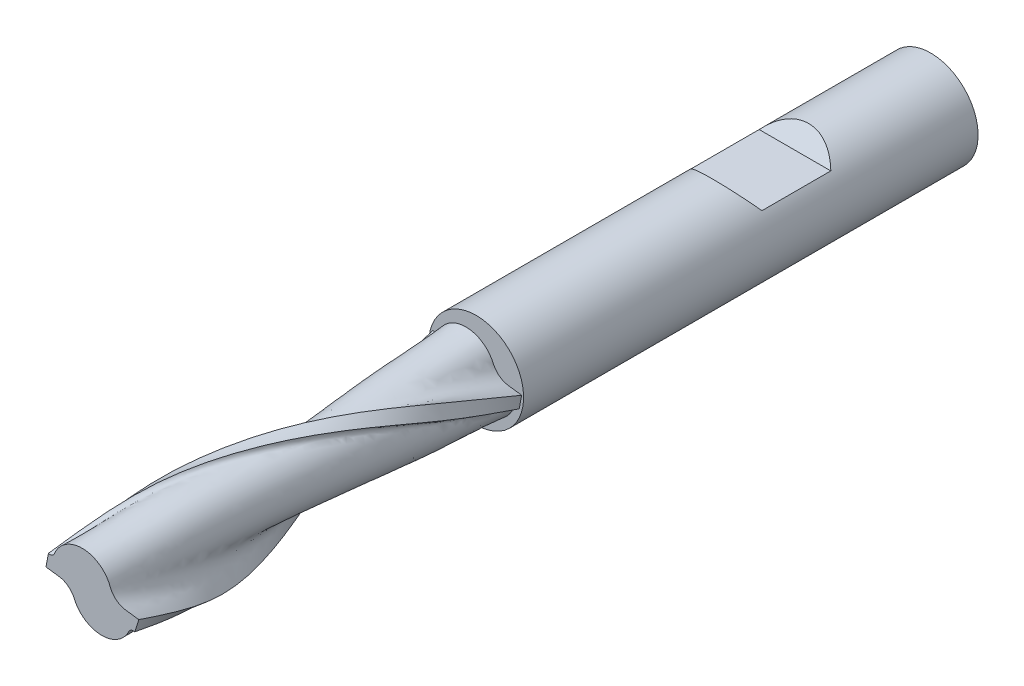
ISO-10303-21;
HEADER;
FILE_DESCRIPTION(('STEP AP214'),'2;1');
FILE_NAME('part.step','',(''),(''),'','','');
FILE_SCHEMA(('AUTOMOTIVE_DESIGN { 1 0 10303 214 1 1 1 1 }'));
ENDSEC;
DATA;
#1=APPLICATION_CONTEXT('core data for automotive mechanical design processes');
#2=APPLICATION_PROTOCOL_DEFINITION('international standard','automotive_design',2000,#1);
#3=PRODUCT_CONTEXT('',#1,'mechanical');
#4=PRODUCT('Part','Part','',(#3));
#5=PRODUCT_RELATED_PRODUCT_CATEGORY('part','',(#4));
#6=PRODUCT_DEFINITION_FORMATION('','',#4);
#7=PRODUCT_DEFINITION_CONTEXT('part definition',#1,'design');
#8=PRODUCT_DEFINITION('design','',#6,#7);
#9=PRODUCT_DEFINITION_SHAPE('','',#8);
#10=(LENGTH_UNIT() NAMED_UNIT(*) SI_UNIT(.MILLI.,.METRE.));
#11=(NAMED_UNIT(*) PLANE_ANGLE_UNIT() SI_UNIT($,.RADIAN.));
#12=(NAMED_UNIT(*) SI_UNIT($,.STERADIAN.) SOLID_ANGLE_UNIT());
#13=UNCERTAINTY_MEASURE_WITH_UNIT(LENGTH_MEASURE(1.E-05),#10,'distance_accuracy_value','');
#14=(GEOMETRIC_REPRESENTATION_CONTEXT(3) GLOBAL_UNCERTAINTY_ASSIGNED_CONTEXT((#13)) GLOBAL_UNIT_ASSIGNED_CONTEXT((#10,
#11,#12)) REPRESENTATION_CONTEXT('',''));
#15=CARTESIAN_POINT('',(0.,0.,0.));
#16=DIRECTION('',(0.,0.,1.));
#17=DIRECTION('',(1.,0.,0.));
#18=AXIS2_PLACEMENT_3D('',#15,#16,#17);
#19=CARTESIAN_POINT('',(4.86838101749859,2.7502276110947,50.7992299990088));
#20=DIRECTION('',(0.0005535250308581,-3.95874720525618E-07,-0.99999984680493));
#21=DIRECTION('',(0.999998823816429,-0.00143037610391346,0.000553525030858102));
#22=AXIS2_PLACEMENT_3D('',#19,#20,#21);
#23=PLANE('',#22);
#24=DIRECTION('',(-0.991036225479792,0.133592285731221,-0.000548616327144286));
#25=VECTOR('',#24,1.);
#26=CARTESIAN_POINT('',(6.25749999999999,0.,50.8));
#27=LINE('',#26,#25);
#28=CARTESIAN_POINT('',(6.25749999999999,0.,50.8));
#29=VERTEX_POINT('',#28);
#30=CARTESIAN_POINT('',(4.52905666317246,0.23299521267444,50.7990431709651));
#31=VERTEX_POINT('',#30);
#32=EDGE_CURVE('E244',#29,#31,#27,.T.);
#33=ORIENTED_EDGE('',*,*,#32,.T.);
#34=CARTESIAN_POINT('',(4.86838101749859,2.7502276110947,50.7992299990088));
#35=DIRECTION('',(0.0005535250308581,-3.95874720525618E-07,-0.99999984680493));
#36=DIRECTION('',(0.999998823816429,-0.00143037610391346,0.000553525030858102));
#37=AXIS2_PLACEMENT_3D('',#34,#35,#36);
#38=CIRCLE('',#37,2.54000000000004);
#39=CARTESIAN_POINT('',(2.49141543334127,1.85488807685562,50.7979146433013));
#40=VERTEX_POINT('',#39);
#41=EDGE_CURVE('E241',#31,#40,#38,.T.);
#42=ORIENTED_EDGE('',*,*,#41,.T.);
#43=CARTESIAN_POINT('',(-1.22241928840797,0.45598559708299,50.7958594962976));
#44=DIRECTION('',(-0.0005535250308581,3.95874720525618E-07,0.99999984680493));
#45=DIRECTION('',(-0.999998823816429,0.00143037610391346,-0.000553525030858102));
#46=AXIS2_PLACEMENT_3D('',#43,#44,#45);
#47=CIRCLE('',#46,3.96856406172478);
#48=CARTESIAN_POINT('',(-4.88731112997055,1.9785046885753,50.7938302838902));
#49=VERTEX_POINT('',#48);
#50=EDGE_CURVE('E238',#40,#49,#47,.T.);
#51=ORIENTED_EDGE('',*,*,#50,.T.);
#52=CARTESIAN_POINT('',(-5.4737213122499,2.22211916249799,50.7935055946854));
#53=DIRECTION('',(0.0005535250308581,-3.95874720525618E-07,-0.99999984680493));
#54=DIRECTION('',(0.999998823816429,-0.00143037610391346,0.000553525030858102));
#55=AXIS2_PLACEMENT_3D('',#52,#53,#54);
#56=CIRCLE('',#55,0.635000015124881);
#57=CARTESIAN_POINT('',(-5.55855240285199,1.59281104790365,50.7934588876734));
#58=VERTEX_POINT('',#57);
#59=EDGE_CURVE('E235',#49,#58,#56,.T.);
#60=ORIENTED_EDGE('',*,*,#59,.T.);
#61=DIRECTION('',(-0.991036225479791,0.13359228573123,-0.000548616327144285));
#62=VECTOR('',#61,1.);
#63=CARTESIAN_POINT('',(-5.55855240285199,1.59281104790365,50.7934588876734));
#64=LINE('',#63,#62);
#65=CARTESIAN_POINT('',(-5.6785293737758,1.60898401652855,50.7933924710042));
#66=VERTEX_POINT('',#65);
#67=EDGE_CURVE('E232',#58,#66,#64,.T.);
#68=ORIENTED_EDGE('',*,*,#67,.T.);
#69=DIRECTION('',(-0.182711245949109,-0.983166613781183,-0.000100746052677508));
#70=VECTOR('',#69,1.);
#71=CARTESIAN_POINT('',(-5.99808234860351,-0.110525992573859,50.7932162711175));
#72=LINE('',#71,#70);
#73=CARTESIAN_POINT('',(-5.99808234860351,-0.110525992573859,50.7932162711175));
#74=VERTEX_POINT('',#73);
#75=EDGE_CURVE('E229',#66,#74,#72,.T.);
#76=ORIENTED_EDGE('',*,*,#75,.T.);
#77=DIRECTION('',(0.991309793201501,-0.131546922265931,0.00054876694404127));
#78=VECTOR('',#77,1.);
#79=CARTESIAN_POINT('',(-5.99808234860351,-0.110525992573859,50.7932162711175));
#80=LINE('',#79,#78);
#81=CARTESIAN_POINT('',(-4.26916188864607,-0.339953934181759,50.7941733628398));
#82=VERTEX_POINT('',#81);
#83=EDGE_CURVE('E226',#74,#82,#80,.T.);
#84=ORIENTED_EDGE('',*,*,#83,.T.);
#85=CARTESIAN_POINT('',(-4.60329102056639,-2.85788119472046,50.7939894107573));
#86=DIRECTION('',(0.0005535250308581,-3.95874720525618E-07,-0.99999984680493));
#87=DIRECTION('',(0.999998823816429,-0.00143037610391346,0.000553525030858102));
#88=AXIS2_PLACEMENT_3D('',#85,#86,#87);
#89=CIRCLE('',#88,2.54000000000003);
#90=CARTESIAN_POINT('',(-2.27038428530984,-1.85331935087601,50.7952803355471));
#91=VERTEX_POINT('',#90);
#92=EDGE_CURVE('E223',#82,#91,#89,.T.);
#93=ORIENTED_EDGE('',*,*,#92,.T.);
#94=CARTESIAN_POINT('',(1.37461171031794,-0.283765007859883,50.7972973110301));
#95=DIRECTION('',(-0.0005535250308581,3.95874720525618E-07,0.99999984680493));
#96=DIRECTION('',(0.999998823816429,-0.00143037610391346,0.000553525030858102));
#97=AXIS2_PLACEMENT_3D('',#94,#95,#96);
#98=CIRCLE('',#97,3.96856406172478);
#99=CARTESIAN_POINT('',(4.95068292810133,-2.00458209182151,50.7992774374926));
#100=VERTEX_POINT('',#99);
#101=EDGE_CURVE('E220',#91,#100,#98,.T.);
#102=ORIENTED_EDGE('',*,*,#101,.T.);
#103=CARTESIAN_POINT('',(5.52288114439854,-2.27992573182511,50.7995942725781));
#104=DIRECTION('',(0.0005535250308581,-3.95874720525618E-07,-0.99999984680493));
#105=DIRECTION('',(-0.999998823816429,0.00143037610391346,-0.000553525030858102));
#106=AXIS2_PLACEMENT_3D('',#103,#104,#105);
#107=CIRCLE('',#106,0.635000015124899);
#108=CARTESIAN_POINT('',(5.60641342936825,-1.65044390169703,50.7996402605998));
#109=VERTEX_POINT('',#108);
#110=EDGE_CURVE('E217',#100,#109,#107,.T.);
#111=ORIENTED_EDGE('',*,*,#110,.T.);
#112=DIRECTION('',(0.9913097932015,-0.131546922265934,0.00054876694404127));
#113=VECTOR('',#112,1.);
#114=CARTESIAN_POINT('',(5.72642351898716,-1.66636925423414,50.799706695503));
#115=LINE('',#114,#113);
#116=CARTESIAN_POINT('',(5.72642351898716,-1.66636925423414,50.799706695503));
#117=VERTEX_POINT('',#116);
#118=EDGE_CURVE('E214',#109,#117,#115,.T.);
#119=ORIENTED_EDGE('',*,*,#118,.T.);
#120=DIRECTION('',(0.303654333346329,0.952782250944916,0.000167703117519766));
#121=VECTOR('',#120,1.);
#122=CARTESIAN_POINT('',(6.25749999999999,0.,50.8));
#123=LINE('',#122,#121);
#124=EDGE_CURVE('E155',#117,#29,#123,.T.);
#125=ORIENTED_EDGE('',*,*,#124,.T.);
#126=EDGE_LOOP('',(#33,#42,#51,#60,#68,#76,#84,#93,#102,#111,#119,#125));
#127=FACE_BOUND('',#126,.T.);
#128=ADVANCED_FACE('F29',(#127),#23,.F.);
#129=CARTESIAN_POINT('',(-5.72880751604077,1.6671271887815,0.));
#130=CARTESIAN_POINT('',(-5.85990323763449,0.491423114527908,3.16051720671));
#131=CARTESIAN_POINT('',(-6.12204647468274,-1.85955270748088,9.48038944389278));
#132=CARTESIAN_POINT('',(-3.94449531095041,-4.9155339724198,18.9685630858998));
#133=CARTESIAN_POINT('',(-0.433616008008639,-6.36220092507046,29.0078604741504));
#134=CARTESIAN_POINT('',(3.75787425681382,-5.38234695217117,39.6233627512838));
#135=CARTESIAN_POINT('',(5.07027525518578,-2.90496275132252,47.0744564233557));
#136=CARTESIAN_POINT('',(5.72642351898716,-1.66636925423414,50.799706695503));
#137=CARTESIAN_POINT('',(-5.90503834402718,1.11141812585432,0.));
#138=CARTESIAN_POINT('',(-5.92164174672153,-0.0798295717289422,3.16050721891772));
#139=CARTESIAN_POINT('',(-5.95484244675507,-2.4618869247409,9.48035948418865));
#140=CARTESIAN_POINT('',(-3.47394434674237,-5.31314633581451,18.9686846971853));
#141=CARTESIAN_POINT('',(0.187027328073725,-6.41993953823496,29.0079403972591));
#142=CARTESIAN_POINT('',(4.29280588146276,-5.02827387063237,39.6234379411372));
#143=CARTESIAN_POINT('',(5.36659646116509,-2.41663054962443,47.0745466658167));
#144=CARTESIAN_POINT('',(5.9034490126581,-1.11091283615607,50.7998044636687));
#145=CARTESIAN_POINT('',(-6.08126917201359,0.555709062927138,0.));
#146=CARTESIAN_POINT('',(-5.98338025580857,-0.651082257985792,3.16049723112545));
#147=CARTESIAN_POINT('',(-5.78763841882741,-3.06422114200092,9.48032952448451));
#148=CARTESIAN_POINT('',(-3.00339338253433,-5.71075869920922,18.9688063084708));
#149=CARTESIAN_POINT('',(0.80767066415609,-6.47767815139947,29.0080203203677));
#150=CARTESIAN_POINT('',(4.82773750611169,-4.67420078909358,39.6235131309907));
#151=CARTESIAN_POINT('',(5.6629176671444,-1.92829834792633,47.0746369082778));
#152=CARTESIAN_POINT('',(6.08047450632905,-0.555456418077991,50.7999022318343));
#153=CARTESIAN_POINT('',(-6.2575,0.,0.));
#154=CARTESIAN_POINT('',(-6.04511876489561,-1.22233494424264,3.16048724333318));
#155=CARTESIAN_POINT('',(-5.62043439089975,-3.66655535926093,9.48029956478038));
#156=CARTESIAN_POINT('',(-2.53284241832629,-6.10837106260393,18.9689279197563));
#157=CARTESIAN_POINT('',(1.42831400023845,-6.53541676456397,29.0081002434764));
#158=CARTESIAN_POINT('',(5.36266913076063,-4.32012770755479,39.6235883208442));
#159=CARTESIAN_POINT('',(5.95923887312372,-1.43996614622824,47.0747271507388));
#160=CARTESIAN_POINT('',(6.25749999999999,0.,50.8));
#161=B_SPLINE_SURFACE_WITH_KNOTS('',3,3,((#129,#130,#131,#132,#133,#134,#135,#136),(#137,#138,
#139,#140,#141,#142,#143,#144),(#145,#146,#147,#148,#149,#150,#151,#152),(#153,#154,#155,#156,
#157,#158,#159,#160)),.UNSPECIFIED.,.F.,.F.,.F.,(4,4),(4,1,1,1,1,4),(0.938550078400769,1.),(0.,
0.186719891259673,0.373371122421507,0.560117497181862,0.780076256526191,1.),.UNSPECIFIED.);
#162=DIRECTION('',(-0.30229123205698,-0.953215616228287,0.));
#163=VECTOR('',#162,1.);
#164=CARTESIAN_POINT('',(-6.2575,0.,0.));
#165=LINE('',#164,#163);
#166=CARTESIAN_POINT('',(-5.72880751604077,1.6671271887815,0.));
#167=VERTEX_POINT('',#166);
#168=CARTESIAN_POINT('',(-6.2575,0.,0.));
#169=VERTEX_POINT('',#168);
#170=EDGE_CURVE('E146',#167,#169,#165,.T.);
#171=CARTESIAN_POINT('',(-6.2575,0.,0.));
#172=CARTESIAN_POINT('',(-6.04511876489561,-1.22233494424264,3.16048724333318));
#173=CARTESIAN_POINT('',(-5.62043439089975,-3.66655535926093,9.48029956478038));
#174=CARTESIAN_POINT('',(-2.53284241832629,-6.10837106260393,18.9689279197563));
#175=CARTESIAN_POINT('',(1.42831400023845,-6.53541676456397,29.0081002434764));
#176=CARTESIAN_POINT('',(5.36266913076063,-4.32012770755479,39.6235883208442));
#177=CARTESIAN_POINT('',(5.95923887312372,-1.43996614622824,47.0747271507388));
#178=CARTESIAN_POINT('',(6.25749999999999,0.,50.8));
#179=B_SPLINE_CURVE_WITH_KNOTS('',3,(#171,#172,#173,#174,#175,#176,#177,#178),.UNSPECIFIED.,.F.,
.F.,(4,1,1,1,1,4),(0.,0.186719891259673,0.373371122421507,0.560117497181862,0.780076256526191,
1.),.UNSPECIFIED.);
#180=EDGE_CURVE('E170',#169,#29,#179,.T.);
#181=CARTESIAN_POINT('',(-5.72880751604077,1.6671271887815,0.));
#182=CARTESIAN_POINT('',(-5.85990323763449,0.491423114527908,3.16051720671));
#183=CARTESIAN_POINT('',(-6.12204647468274,-1.85955270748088,9.48038944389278));
#184=CARTESIAN_POINT('',(-3.94449531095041,-4.9155339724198,18.9685630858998));
#185=CARTESIAN_POINT('',(-0.433616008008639,-6.36220092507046,29.0078604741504));
#186=CARTESIAN_POINT('',(3.75787425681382,-5.38234695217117,39.6233627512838));
#187=CARTESIAN_POINT('',(5.07027525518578,-2.90496275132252,47.0744564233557));
#188=CARTESIAN_POINT('',(5.72642351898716,-1.66636925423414,50.799706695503));
#189=B_SPLINE_CURVE_WITH_KNOTS('',3,(#181,#182,#183,#184,#185,#186,#187,#188),.UNSPECIFIED.,.F.,
.F.,(4,1,1,1,1,4),(0.,0.186719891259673,0.373371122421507,0.560117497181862,0.780076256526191,
1.),.UNSPECIFIED.);
#190=EDGE_CURVE('E163',#167,#117,#189,.T.);
#191=ORIENTED_EDGE('',*,*,#170,.T.);
#192=ORIENTED_EDGE('',*,*,#180,.T.);
#193=ORIENTED_EDGE('',*,*,#124,.F.);
#194=ORIENTED_EDGE('',*,*,#190,.F.);
#195=EDGE_LOOP('',(#191,#192,#193,#194));
#196=FACE_BOUND('',#195,.T.);
#197=ADVANCED_FACE('F262',(#196),#161,.T.);
#198=CARTESIAN_POINT('',(5.99791359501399,0.128055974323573,0.));
#199=CARTESIAN_POINT('',(5.76919163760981,1.29439054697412,3.16109072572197));
#200=CARTESIAN_POINT('',(5.31183182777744,3.62663081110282,9.48210979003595));
#201=CARTESIAN_POINT('',(2.31951774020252,5.899436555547,18.9598958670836));
#202=CARTESIAN_POINT('',(-1.49250196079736,6.23906689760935,29.0040798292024));
#203=CARTESIAN_POINT('',(-5.22022430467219,4.0393450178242,39.6192683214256));
#204=CARTESIAN_POINT('',(-5.73881009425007,1.2726909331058,47.0687646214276));
#205=CARTESIAN_POINT('',(-5.99808234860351,-0.110525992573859,50.7932162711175));
#206=CARTESIAN_POINT('',(5.4214978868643,0.203707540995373,0.));
#207=CARTESIAN_POINT('',(5.19757465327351,1.2549214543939,3.16106253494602));
#208=CARTESIAN_POINT('',(4.74981052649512,3.35696273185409,9.48202522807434));
#209=CARTESIAN_POINT('',(2.01161619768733,5.36783707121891,18.9603218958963));
#210=CARTESIAN_POINT('',(-1.44045343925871,5.61966368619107,29.0042656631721));
#211=CARTESIAN_POINT('',(-4.77891449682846,3.57623080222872,39.619469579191));
#212=CARTESIAN_POINT('',(-5.20749989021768,1.06734238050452,47.0690443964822));
#213=CARTESIAN_POINT('',(-5.42177552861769,-0.187001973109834,50.7935353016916));
#214=CARTESIAN_POINT('',(4.84508217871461,0.279359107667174,0.));
#215=CARTESIAN_POINT('',(4.62595766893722,1.21545236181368,3.16103434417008));
#216=CARTESIAN_POINT('',(4.18778922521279,3.08729465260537,9.48194066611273));
#217=CARTESIAN_POINT('',(1.70371465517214,4.83623758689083,18.960747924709));
#218=CARTESIAN_POINT('',(-1.38840491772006,5.00026047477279,29.0044514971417));
#219=CARTESIAN_POINT('',(-4.33760468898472,3.11311658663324,39.6196708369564));
#220=CARTESIAN_POINT('',(-4.67618968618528,0.861993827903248,47.0693241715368));
#221=CARTESIAN_POINT('',(-4.84546870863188,-0.263477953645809,50.7938543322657));
#222=CARTESIAN_POINT('',(4.26866647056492,0.355010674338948,0.));
#223=CARTESIAN_POINT('',(4.05434068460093,1.17598326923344,3.16100615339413));
#224=CARTESIAN_POINT('',(3.62576792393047,2.81762657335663,9.48185610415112));
#225=CARTESIAN_POINT('',(1.39581311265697,4.30463810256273,18.9611739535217));
#226=CARTESIAN_POINT('',(-1.33635639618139,4.38085726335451,29.0046373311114));
#227=CARTESIAN_POINT('',(-3.89629488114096,2.65000237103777,39.6198720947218));
#228=CARTESIAN_POINT('',(-4.14487948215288,0.656645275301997,47.0696039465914));
#229=CARTESIAN_POINT('',(-4.26916188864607,-0.339953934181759,50.7941733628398));
#230=CARTESIAN_POINT('',(3.36128350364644,0.474099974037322,0.));
#231=CARTESIAN_POINT('',(3.15451178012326,1.11385175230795,3.16096177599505));
#232=CARTESIAN_POINT('',(2.74104436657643,2.39312006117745,9.48172298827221));
#233=CARTESIAN_POINT('',(0.911120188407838,3.46780400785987,18.961844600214));
#234=CARTESIAN_POINT('',(-1.25442257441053,3.40580416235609,29.0049298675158));
#235=CARTESIAN_POINT('',(-3.20159312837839,1.92097652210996,39.6201889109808));
#236=CARTESIAN_POINT('',(-3.30850076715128,0.333389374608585,47.0700443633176));
#237=CARTESIAN_POINT('',(-3.36195033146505,-0.460341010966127,50.7946755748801));
#238=CARTESIAN_POINT('',(2.63087248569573,1.02548536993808,0.));
#239=CARTESIAN_POINT('',(2.34123521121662,1.50389481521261,3.16092713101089));
#240=CARTESIAN_POINT('',(1.76206716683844,2.46053778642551,9.48161906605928));
#241=CARTESIAN_POINT('',(0.0765731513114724,2.97918361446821,18.9623912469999));
#242=CARTESIAN_POINT('',(-1.66436732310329,2.51732958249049,29.0051471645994));
#243=CARTESIAN_POINT('',(-2.95717284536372,0.944069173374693,39.6204331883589));
#244=CARTESIAN_POINT('',(-2.74060444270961,-0.360525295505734,47.0703951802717));
#245=CARTESIAN_POINT('',(-2.63232886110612,-1.01277060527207,50.7950796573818));
#246=CARTESIAN_POINT('',(2.26772592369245,1.86551553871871,0.));
#247=CARTESIAN_POINT('',(1.82639227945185,2.2444953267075,3.16091124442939));
#248=CARTESIAN_POINT('',(0.943887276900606,3.00231554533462,9.48157141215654));
#249=CARTESIAN_POINT('',(-0.890405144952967,2.96607620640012,18.9626714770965));
#250=CARTESIAN_POINT('',(-2.45938856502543,1.94690601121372,29.0052326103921));
#251=CARTESIAN_POINT('',(-3.2267123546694,-0.0262079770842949,39.6205412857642));
#252=CARTESIAN_POINT('',(-2.58914339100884,-1.24431454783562,47.0705649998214));
#253=CARTESIAN_POINT('',(-2.27038428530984,-1.85331935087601,50.7952803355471));
#254=CARTESIAN_POINT('',(0.700986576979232,5.48969501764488,0.));
#255=CARTESIAN_POINT('',(-0.394817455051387,5.43970101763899,3.16084270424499));
#256=CARTESIAN_POINT('',(-2.58602257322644,5.33973140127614,9.48136581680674));
#257=CARTESIAN_POINT('',(-5.0622825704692,2.90952633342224,18.963880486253));
#258=CARTESIAN_POINT('',(-5.88938403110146,-0.514097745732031,29.0056012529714));
#259=CARTESIAN_POINT('',(-4.38959863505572,-4.21231779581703,39.6210076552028));
#260=CARTESIAN_POINT('',(-1.93568824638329,-5.0572857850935,47.0712976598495));
#261=CARTESIAN_POINT('',(-0.708830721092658,-5.47973614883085,50.7961461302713));
#262=CARTESIAN_POINT('',(-3.24659666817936,5.56673785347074,0.));
#263=CARTESIAN_POINT('',(-4.22341495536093,4.74331483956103,3.16064859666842));
#264=CARTESIAN_POINT('',(-6.17669233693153,3.09677159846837,9.48078356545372));
#265=CARTESIAN_POINT('',(-6.74067209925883,-0.910259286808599,18.9667915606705));
#266=CARTESIAN_POINT('',(-5.07214400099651,-4.65577911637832,29.0068915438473));
#267=CARTESIAN_POINT('',(-1.06249490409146,-7.00627541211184,39.6223963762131));
#268=CARTESIAN_POINT('',(1.80500290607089,-6.04368321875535,47.073217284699));
#269=CARTESIAN_POINT('',(3.23863768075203,-5.56242543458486,50.7983311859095));
#270=CARTESIAN_POINT('',(-4.95355137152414,2.00644928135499,0.));
#271=CARTESIAN_POINT('',(-5.17722549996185,0.970602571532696,3.16055616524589));
#272=CARTESIAN_POINT('',(-5.62449150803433,-1.10070994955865,9.48050630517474));
#273=CARTESIAN_POINT('',(-3.96066749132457,-4.02142208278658,18.9679966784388));
#274=CARTESIAN_POINT('',(-0.964418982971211,-5.62943317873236,29.0075929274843));
#275=CARTESIAN_POINT('',(2.85952753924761,-5.13716864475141,39.6230816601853));
#276=CARTESIAN_POINT('',(4.25366812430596,-3.04872219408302,47.0740765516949));
#277=CARTESIAN_POINT('',(4.95068292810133,-2.00458209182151,50.7992774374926));
#278=CARTESIAN_POINT('',(-5.07654983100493,1.74990468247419,0.));
#279=CARTESIAN_POINT('',(-5.24595446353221,0.698751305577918,3.16054950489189));
#280=CARTESIAN_POINT('',(-5.58470143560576,-1.40316892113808,9.48048632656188));
#281=CARTESIAN_POINT('',(-3.76034800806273,-4.24560391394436,18.9680835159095));
#282=CARTESIAN_POINT('',(-0.668427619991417,-5.6995920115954,29.0076434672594));
#283=CARTESIAN_POINT('',(3.14213768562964,-5.00248595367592,39.6231310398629));
#284=CARTESIAN_POINT('',(4.43011220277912,-2.83291354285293,47.0741384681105));
#285=CARTESIAN_POINT('',(5.07404819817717,-1.74821368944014,50.7993456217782));
#286=CARTESIAN_POINT('',(-5.32668772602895,1.61435105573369,0.));
#287=CARTESIAN_POINT('',(-5.46113113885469,0.518957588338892,3.16053687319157));
#288=CARTESIAN_POINT('',(-5.72996852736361,-1.67142655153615,9.4804484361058));
#289=CARTESIAN_POINT('',(-3.72969668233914,-4.54467892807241,18.968265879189));
#290=CARTESIAN_POINT('',(-0.469926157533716,-5.93009214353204,29.0077308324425));
#291=CARTESIAN_POINT('',(3.45000720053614,-5.05926867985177,39.6232223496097));
#292=CARTESIAN_POINT('',(4.69962201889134,-2.76170725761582,47.07426124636));
#293=CARTESIAN_POINT('',(5.3243796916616,-1.61301799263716,50.7994841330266));
#294=CARTESIAN_POINT('',(-5.60877475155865,1.65137351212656,0.));
#295=CARTESIAN_POINT('',(-5.74086975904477,0.499642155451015,3.1605230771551));
#296=CARTESIAN_POINT('',(-6.00501120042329,-1.80339704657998,9.48040705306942));
#297=CARTESIAN_POINT('',(-3.88037791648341,-4.80483373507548,18.9684743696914));
#298=CARTESIAN_POINT('',(-0.444454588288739,-6.23321644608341,29.0078217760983));
#299=CARTESIAN_POINT('',(3.66597593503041,-5.28590808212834,39.6233208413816));
#300=CARTESIAN_POINT('',(4.95963525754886,-2.86220098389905,47.074398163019));
#301=CARTESIAN_POINT('',(5.60641342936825,-1.65044390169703,50.7996402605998));
#302=CARTESIAN_POINT('',(-5.64878567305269,1.65662473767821,0.));
#303=CARTESIAN_POINT('',(-5.78054758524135,0.496902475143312,3.16052112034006));
#304=CARTESIAN_POINT('',(-6.04402295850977,-1.82211560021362,9.48040118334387));
#305=CARTESIAN_POINT('',(-3.90175038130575,-4.84173381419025,18.9685039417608));
#306=CARTESIAN_POINT('',(-0.440841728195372,-6.27621127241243,29.007834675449));
#307=CARTESIAN_POINT('',(3.69660870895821,-5.31805437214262,39.6233348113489));
#308=CARTESIAN_POINT('',(4.99651525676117,-2.87645490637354,47.0744175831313));
#309=CARTESIAN_POINT('',(5.64641679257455,-1.65575235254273,50.7996624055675));
#310=CARTESIAN_POINT('',(-5.68879659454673,1.66187596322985,0.));
#311=CARTESIAN_POINT('',(-5.82022541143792,0.49416279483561,3.16051916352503));
#312=CARTESIAN_POINT('',(-6.08303471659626,-1.84083415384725,9.48039531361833));
#313=CARTESIAN_POINT('',(-3.92312284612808,-4.87863389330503,18.9685335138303));
#314=CARTESIAN_POINT('',(-0.437228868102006,-6.31920609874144,29.0078475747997));
#315=CARTESIAN_POINT('',(3.72724148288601,-5.35020066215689,39.6233487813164));
#316=CARTESIAN_POINT('',(5.03339525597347,-2.89070882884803,47.0744370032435));
#317=CARTESIAN_POINT('',(5.68642015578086,-1.66106080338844,50.7996845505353));
#318=CARTESIAN_POINT('',(-5.72880751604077,1.6671271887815,0.));
#319=CARTESIAN_POINT('',(-5.85990323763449,0.491423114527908,3.16051720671));
#320=CARTESIAN_POINT('',(-6.12204647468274,-1.85955270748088,9.48038944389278));
#321=CARTESIAN_POINT('',(-3.94449531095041,-4.9155339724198,18.9685630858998));
#322=CARTESIAN_POINT('',(-0.433616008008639,-6.36220092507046,29.0078604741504));
#323=CARTESIAN_POINT('',(3.75787425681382,-5.38234695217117,39.6233627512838));
#324=CARTESIAN_POINT('',(5.07027525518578,-2.90496275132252,47.0744564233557));
#325=CARTESIAN_POINT('',(5.72642351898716,-1.66636925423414,50.799706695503));
#326=(BOUNDED_SURFACE() B_SPLINE_SURFACE(3,3,((#198,#199,#200,#201,#202,#203,#204,#205),(#206,
#207,#208,#209,#210,#211,#212,#213),(#214,#215,#216,#217,#218,#219,#220,#221),(#222,#223,#224,
#225,#226,#227,#228,#229),(#230,#231,#232,#233,#234,#235,#236,#237),(#238,#239,#240,#241,#242,
#243,#244,#245),(#246,#247,#248,#249,#250,#251,#252,#253),(#254,#255,#256,#257,#258,#259,#260,
#261),(#262,#263,#264,#265,#266,#267,#268,#269),(#270,#271,#272,#273,#274,#275,#276,#277),(#278,
#279,#280,#281,#282,#283,#284,#285),(#286,#287,#288,#289,#290,#291,#292,#293),(#294,#295,#296,
#297,#298,#299,#300,#301),(#302,#303,#304,#305,#306,#307,#308,#309),(#310,#311,#312,#313,#314,
#315,#316,#317),(#318,#319,#320,#321,#322,#323,#324,#325)),.UNSPECIFIED.,.F.,.F.,
.F.) B_SPLINE_SURFACE_WITH_KNOTS((4,3,3,3,3,4),(4,1,1,1,1,4),(0.504976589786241,
0.566255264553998,0.654341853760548,0.908111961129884,0.934296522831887,0.938550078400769),(0.,
0.186719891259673,0.373371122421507,0.560117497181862,0.780076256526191,1.),
.UNSPECIFIED.) GEOMETRIC_REPRESENTATION_ITEM() RATIONAL_B_SPLINE_SURFACE(((1.,1.,1.,1.,1.,1.,1.,
1.),(1.,1.,1.,1.,1.,1.,1.,1.),(1.,1.,1.,1.,1.,1.,1.,1.),(1.,1.,1.,1.,1.,1.,1.,1.),
(0.913157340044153,0.913157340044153,0.913157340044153,0.913157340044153,0.913157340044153,
0.913157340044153,0.913157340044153,0.913157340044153),(0.913157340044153,0.913157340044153,
0.913157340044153,0.913157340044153,0.913157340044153,0.913157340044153,0.913157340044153,
0.913157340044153),(1.,1.,1.,1.,1.,1.,1.,1.),(0.609763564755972,0.609763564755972,
0.609763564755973,0.609763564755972,0.609763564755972,0.609763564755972,0.609763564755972,
0.609763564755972),(0.609763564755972,0.609763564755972,0.609763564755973,0.609763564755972,
0.609763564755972,0.609763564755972,0.609763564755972,0.609763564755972),(1.,1.,1.,1.,1.,1.,1.,
1.),(0.873149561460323,0.873149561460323,0.873149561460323,0.873149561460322,0.873149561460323,
0.873149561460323,0.873149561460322,0.873149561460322),(0.873149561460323,0.873149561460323,
0.873149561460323,0.873149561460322,0.873149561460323,0.873149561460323,0.873149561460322,
0.873149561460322),(1.,1.,1.,1.,1.,1.,1.,1.),(1.,1.,1.,1.,1.,1.,1.,1.),(1.,1.,1.,1.,1.,1.,1.,
1.),(1.,1.,1.,1.,1.,1.,1.,1.))) REPRESENTATION_ITEM('') SURFACE());
#327=DIRECTION('',(-0.991497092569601,0.130128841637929,0.));
#328=VECTOR('',#327,1.);
#329=CARTESIAN_POINT('',(5.99791359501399,0.128055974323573,0.));
#330=LINE('',#329,#328);
#331=CARTESIAN_POINT('',(5.99791359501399,0.128055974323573,0.));
#332=VERTEX_POINT('',#331);
#333=CARTESIAN_POINT('',(4.26866647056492,0.355010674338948,0.));
#334=VERTEX_POINT('',#333);
#335=EDGE_CURVE('E196',#332,#334,#330,.T.);
#336=CARTESIAN_POINT('',(4.59919372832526,2.87341328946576,0.));
#337=DIRECTION('',(0.,0.,-1.));
#338=DIRECTION('',(-1.,0.,0.));
#339=AXIS2_PLACEMENT_3D('',#336,#337,#338);
#340=CIRCLE('',#339,2.54000000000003);
#341=CARTESIAN_POINT('',(2.26772592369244,1.86551553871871,0.));
#342=VERTEX_POINT('',#341);
#343=EDGE_CURVE('E193',#334,#342,#340,.T.);
#344=CARTESIAN_POINT('',(-1.3750218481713,0.29074908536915,0.));
#345=DIRECTION('',(0.,0.,1.));
#346=DIRECTION('',(-1.,0.,0.));
#347=AXIS2_PLACEMENT_3D('',#344,#345,#346);
#348=CIRCLE('',#347,3.96856406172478);
#349=CARTESIAN_POINT('',(-4.95355137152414,2.00644928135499,0.));
#350=VERTEX_POINT('',#349);
#351=EDGE_CURVE('E190',#342,#350,#348,.T.);
#352=CARTESIAN_POINT('',(-5.52614293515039,2.2809741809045,0.));
#353=DIRECTION('',(0.,0.,-1.));
#354=DIRECTION('',(1.,0.,0.));
#355=AXIS2_PLACEMENT_3D('',#352,#353,#354);
#356=CIRCLE('',#355,0.635000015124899);
#357=CARTESIAN_POINT('',(-5.60877475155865,1.65137351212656,0.));
#358=VERTEX_POINT('',#357);
#359=EDGE_CURVE('E187',#350,#358,#356,.T.);
#360=DIRECTION('',(-0.9914970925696,0.130128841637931,0.));
#361=VECTOR('',#360,1.);
#362=CARTESIAN_POINT('',(-5.72880751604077,1.6671271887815,0.));
#363=LINE('',#362,#361);
#364=EDGE_CURVE('E184',#358,#167,#363,.T.);
#365=CARTESIAN_POINT('',(5.99791359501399,0.128055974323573,0.));
#366=CARTESIAN_POINT('',(5.76919163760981,1.29439054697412,3.16109072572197));
#367=CARTESIAN_POINT('',(5.31183182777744,3.62663081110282,9.48210979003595));
#368=CARTESIAN_POINT('',(2.31951774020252,5.899436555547,18.9598958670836));
#369=CARTESIAN_POINT('',(-1.49250196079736,6.23906689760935,29.0040798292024));
#370=CARTESIAN_POINT('',(-5.22022430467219,4.0393450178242,39.6192683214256));
#371=CARTESIAN_POINT('',(-5.73881009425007,1.2726909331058,47.0687646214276));
#372=CARTESIAN_POINT('',(-5.99808234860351,-0.110525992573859,50.7932162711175));
#373=B_SPLINE_CURVE_WITH_KNOTS('',3,(#365,#366,#367,#368,#369,#370,#371,#372),.UNSPECIFIED.,.F.,
.F.,(4,1,1,1,1,4),(0.,0.186719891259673,0.373371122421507,0.560117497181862,0.780076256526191,
1.),.UNSPECIFIED.);
#374=EDGE_CURVE('E154',#332,#74,#373,.T.);
#375=ORIENTED_EDGE('',*,*,#335,.T.);
#376=ORIENTED_EDGE('',*,*,#343,.T.);
#377=ORIENTED_EDGE('',*,*,#351,.T.);
#378=ORIENTED_EDGE('',*,*,#359,.T.);
#379=ORIENTED_EDGE('',*,*,#364,.T.);
#380=ORIENTED_EDGE('',*,*,#190,.T.);
#381=ORIENTED_EDGE('',*,*,#118,.F.);
#382=ORIENTED_EDGE('',*,*,#110,.F.);
#383=ORIENTED_EDGE('',*,*,#101,.F.);
#384=ORIENTED_EDGE('',*,*,#92,.F.);
#385=ORIENTED_EDGE('',*,*,#83,.F.);
#386=ORIENTED_EDGE('',*,*,#374,.F.);
#387=EDGE_LOOP('',(#375,#376,#377,#378,#379,#380,#381,#382,#383,#384,#385,#386));
#388=FACE_BOUND('',#387,.T.);
#389=ADVANCED_FACE('F264',(#388),#326,.T.);
#390=CARTESIAN_POINT('',(5.68082044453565,-1.59190935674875,0.));
#391=CARTESIAN_POINT('',(5.79870845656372,-0.429094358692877,3.16107105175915));
#392=CARTESIAN_POINT('',(6.03444113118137,1.89610805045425,9.48205077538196));
#393=CARTESIAN_POINT('',(3.86865376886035,4.89156660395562,18.9601039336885));
#394=CARTESIAN_POINT('',(0.376509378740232,6.29893139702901,29.004252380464));
#395=CARTESIAN_POINT('',(-3.76010957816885,5.29303609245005,39.6194206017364));
#396=CARTESIAN_POINT('',(-5.03909004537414,2.83693620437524,47.0689328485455));
#397=CARTESIAN_POINT('',(-5.6785293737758,1.60898401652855,50.7933924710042));
#398=CARTESIAN_POINT('',(5.78651816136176,-1.01858757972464,0.));
#399=CARTESIAN_POINT('',(5.78886951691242,0.145400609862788,3.16107760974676));
#400=CARTESIAN_POINT('',(5.79357136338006,2.47294897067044,9.48207044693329));
#401=CARTESIAN_POINT('',(3.35227509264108,5.22752325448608,18.9600345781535));
#402=CARTESIAN_POINT('',(-0.246494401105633,6.27897656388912,29.0041948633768));
#403=CARTESIAN_POINT('',(-4.2468144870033,4.87513906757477,39.6193698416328));
#404=CARTESIAN_POINT('',(-5.27233006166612,2.3155211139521,47.0688767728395));
#405=CARTESIAN_POINT('',(-5.7850470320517,1.03581401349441,50.7933337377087));
#406=CARTESIAN_POINT('',(5.89221587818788,-0.445265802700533,0.));
#407=CARTESIAN_POINT('',(5.77903057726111,0.719895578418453,3.16108416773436));
#408=CARTESIAN_POINT('',(5.55270159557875,3.04978989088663,9.48209011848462));
#409=CARTESIAN_POINT('',(2.8358964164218,5.56347990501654,18.9599652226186));
#410=CARTESIAN_POINT('',(-0.869498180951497,6.25902173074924,29.0041373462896));
#411=CARTESIAN_POINT('',(-4.73351939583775,4.45724204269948,39.6193190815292));
#412=CARTESIAN_POINT('',(-5.5055700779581,1.79410602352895,47.0688206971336));
#413=CARTESIAN_POINT('',(-5.8915646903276,0.462644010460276,50.7932750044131));
#414=CARTESIAN_POINT('',(5.99791359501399,0.128055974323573,0.));
#415=CARTESIAN_POINT('',(5.76919163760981,1.29439054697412,3.16109072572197));
#416=CARTESIAN_POINT('',(5.31183182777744,3.62663081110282,9.48210979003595));
#417=CARTESIAN_POINT('',(2.31951774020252,5.899436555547,18.9598958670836));
#418=CARTESIAN_POINT('',(-1.49250196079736,6.23906689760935,29.0040798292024));
#419=CARTESIAN_POINT('',(-5.22022430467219,4.0393450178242,39.6192683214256));
#420=CARTESIAN_POINT('',(-5.73881009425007,1.2726909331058,47.0687646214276));
#421=CARTESIAN_POINT('',(-5.99808234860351,-0.110525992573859,50.7932162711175));
#422=B_SPLINE_SURFACE_WITH_KNOTS('',3,3,((#390,#391,#392,#393,#394,#395,#396,#397),(#398,#399,
#400,#401,#402,#403,#404,#405),(#406,#407,#408,#409,#410,#411,#412,#413),(#414,#415,#416,#417,
#418,#419,#420,#421)),.UNSPECIFIED.,.F.,.F.,.F.,(4,4),(4,1,1,1,1,4),(0.443526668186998,
0.504976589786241),(0.,0.186719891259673,0.373371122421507,0.560117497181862,0.780076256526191,
1.),.UNSPECIFIED.);
#423=DIRECTION('',(0.181304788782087,0.983426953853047,0.));
#424=VECTOR('',#423,1.);
#425=CARTESIAN_POINT('',(5.99791359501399,0.128055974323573,0.));
#426=LINE('',#425,#424);
#427=CARTESIAN_POINT('',(5.68082044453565,-1.59190935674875,0.));
#428=VERTEX_POINT('',#427);
#429=EDGE_CURVE('E199',#428,#332,#426,.T.);
#430=CARTESIAN_POINT('',(5.68082044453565,-1.59190935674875,0.));
#431=CARTESIAN_POINT('',(5.79870845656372,-0.429094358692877,3.16107105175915));
#432=CARTESIAN_POINT('',(6.03444113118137,1.89610805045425,9.48205077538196));
#433=CARTESIAN_POINT('',(3.86865376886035,4.89156660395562,18.9601039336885));
#434=CARTESIAN_POINT('',(0.376509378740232,6.29893139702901,29.004252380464));
#435=CARTESIAN_POINT('',(-3.76010957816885,5.29303609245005,39.6194206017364));
#436=CARTESIAN_POINT('',(-5.03909004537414,2.83693620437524,47.0689328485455));
#437=CARTESIAN_POINT('',(-5.6785293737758,1.60898401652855,50.7933924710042));
#438=B_SPLINE_CURVE_WITH_KNOTS('',3,(#430,#431,#432,#433,#434,#435,#436,#437),.UNSPECIFIED.,.F.,
.F.,(4,1,1,1,1,4),(0.,0.186719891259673,0.373371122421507,0.560117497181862,0.780076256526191,
1.),.UNSPECIFIED.);
#439=EDGE_CURVE('E149',#428,#66,#438,.T.);
#440=ORIENTED_EDGE('',*,*,#429,.T.);
#441=ORIENTED_EDGE('',*,*,#374,.T.);
#442=ORIENTED_EDGE('',*,*,#75,.F.);
#443=ORIENTED_EDGE('',*,*,#439,.F.);
#444=EDGE_LOOP('',(#440,#441,#442,#443));
#445=FACE_BOUND('',#444,.T.);
#446=ADVANCED_FACE('F31',(#445),#422,.T.);
#447=CARTESIAN_POINT('',(-6.2575,0.,0.));
#448=CARTESIAN_POINT('',(-6.04511876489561,-1.22233494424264,3.16048724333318));
#449=CARTESIAN_POINT('',(-5.62043439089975,-3.66655535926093,9.48029956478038));
#450=CARTESIAN_POINT('',(-2.53284241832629,-6.10837106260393,18.9689279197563));
#451=CARTESIAN_POINT('',(1.42831400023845,-6.53541676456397,29.0081002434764));
#452=CARTESIAN_POINT('',(5.36266913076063,-4.32012770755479,39.6235883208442));
#453=CARTESIAN_POINT('',(5.95923887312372,-1.43996614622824,47.0747271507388));
#454=CARTESIAN_POINT('',(6.25749999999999,0.,50.8));
#455=CARTESIAN_POINT('',(-5.68124163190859,-0.0768408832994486,0.));
#456=CARTESIAN_POINT('',(-5.47342155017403,-1.18404551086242,3.1605154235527));
#457=CARTESIAN_POINT('',(-5.05785780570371,-3.3980476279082,9.48038409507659));
#458=CARTESIAN_POINT('',(-2.22384453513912,-5.57740808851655,18.9685019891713));
#459=CARTESIAN_POINT('',(1.37754377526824,-5.9159074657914,29.007914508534));
#460=CARTESIAN_POINT('',(4.92231593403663,-3.85610380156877,39.6233871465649));
#461=CARTESIAN_POINT('',(5.42835355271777,-1.23352163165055,47.0744474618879));
#462=CARTESIAN_POINT('',(5.68135222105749,0.0776650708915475,50.7996810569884));
#463=CARTESIAN_POINT('',(-5.10498326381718,-0.153681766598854,0.));
#464=CARTESIAN_POINT('',(-4.90172433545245,-1.1457560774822,3.16054360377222));
#465=CARTESIAN_POINT('',(-4.49528122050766,-3.12953989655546,9.48046862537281));
#466=CARTESIAN_POINT('',(-1.91484665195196,-5.04644511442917,18.9680760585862));
#467=CARTESIAN_POINT('',(1.32677355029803,-5.29639816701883,29.0077287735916));
#468=CARTESIAN_POINT('',(4.48196273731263,-3.39207989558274,39.6231859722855));
#469=CARTESIAN_POINT('',(4.89746823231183,-1.02707711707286,47.0741677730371));
#470=CARTESIAN_POINT('',(5.10520444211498,0.155330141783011,50.7993621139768));
#471=CARTESIAN_POINT('',(-4.52872489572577,-0.230522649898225,0.));
#472=CARTESIAN_POINT('',(-4.33002712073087,-1.10746664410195,3.16057178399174));
#473=CARTESIAN_POINT('',(-3.93270463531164,-2.86103216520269,9.48055315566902));
#474=CARTESIAN_POINT('',(-1.60584876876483,-4.51548214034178,18.9676501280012));
#475=CARTESIAN_POINT('',(1.27600332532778,-4.67688886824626,29.0075430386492));
#476=CARTESIAN_POINT('',(4.0416095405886,-2.92805598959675,39.6229847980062));
#477=CARTESIAN_POINT('',(4.36658291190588,-0.820632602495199,47.0738880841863));
#478=CARTESIAN_POINT('',(4.52905666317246,0.23299521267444,50.7990431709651));
#479=CARTESIAN_POINT('',(-3.57866718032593,-0.357207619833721,0.));
#480=CARTESIAN_POINT('',(-3.38748922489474,-1.04434014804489,3.16061824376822));
#481=CARTESIAN_POINT('',(-3.00520361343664,-2.41835253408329,9.48069251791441));
#482=CARTESIAN_POINT('',(-1.09641439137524,-3.6401014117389,18.9669479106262));
#483=CARTESIAN_POINT('',(1.19230016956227,-3.65552480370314,29.0072368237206));
#484=CARTESIAN_POINT('',(3.31561409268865,-2.16303544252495,39.6226531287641));
#485=CARTESIAN_POINT('',(3.49133020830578,-0.480274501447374,47.0734269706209));
#486=CARTESIAN_POINT('',(3.57918127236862,0.361038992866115,50.7985173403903));
#487=CARTESIAN_POINT('',(-2.82790376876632,-0.953037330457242,0.));
#488=CARTESIAN_POINT('',(-2.54587298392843,-1.47334449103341,3.16065378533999));
#489=CARTESIAN_POINT('',(-1.98191512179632,-2.51376748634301,9.48079912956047));
#490=CARTESIAN_POINT('',(-0.210243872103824,-3.14967634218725,18.9663855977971));
#491=CARTESIAN_POINT('',(1.64404886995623,-2.73568026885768,29.007014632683));
#492=CARTESIAN_POINT('',(3.08447924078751,-1.13400553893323,39.6224027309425));
#493=CARTESIAN_POINT('',(2.91433590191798,0.260663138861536,47.073066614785));
#494=CARTESIAN_POINT('',(2.82927100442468,0.957941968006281,50.7981020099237));
#495=CARTESIAN_POINT('',(-2.48876552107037,-1.8494992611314,0.));
#496=CARTESIAN_POINT('',(-2.04320424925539,-2.27314869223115,3.160668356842));
#497=CARTESIAN_POINT('',(-1.15224554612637,-3.12029177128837,9.4808428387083));
#498=CARTESIAN_POINT('',(0.802036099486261,-3.18290891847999,18.9661222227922));
#499=CARTESIAN_POINT('',(2.50348588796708,-2.1775056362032,29.0069393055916));
#500=CARTESIAN_POINT('',(3.4135745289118,-0.131996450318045,39.6223044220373));
#501=CARTESIAN_POINT('',(2.79878548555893,1.19262838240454,47.0729089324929));
#502=CARTESIAN_POINT('',(2.49141543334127,1.85488807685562,50.7979146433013));
#503=CARTESIAN_POINT('',(-0.984822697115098,-5.82495026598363,0.));
#504=CARTESIAN_POINT('',(0.185931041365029,-5.81996122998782,3.16073297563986));
#505=CARTESIAN_POINT('',(2.52700801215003,-5.80998499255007,9.48103667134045));
#506=CARTESIAN_POINT('',(5.2910939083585,-3.3302821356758,18.9649542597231));
#507=CARTESIAN_POINT('',(6.314746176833,0.297776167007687,29.0066052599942));
#508=CARTESIAN_POINT('',(4.87298083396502,4.31151409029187,39.6218684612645));
#509=CARTESIAN_POINT('',(2.28636548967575,5.32552241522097,47.0722096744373));
#510=CARTESIAN_POINT('',(0.993160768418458,5.83248621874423,50.7970837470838));
#511=CARTESIAN_POINT('',(3.26509662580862,-5.89006906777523,0.));
#512=CARTESIAN_POINT('',(4.30427132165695,-5.0530211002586,3.16094199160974));
#513=CARTESIAN_POINT('',(6.38223859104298,-3.3792329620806,9.48166364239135));
#514=CARTESIAN_POINT('',(7.08063852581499,0.789290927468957,18.9618204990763));
#515=CARTESIAN_POINT('',(5.41629379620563,4.75260560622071,29.0052154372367));
#516=CARTESIAN_POINT('',(1.27874438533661,7.30419101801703,39.6203729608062));
#517=CARTESIAN_POINT('',(-1.74493904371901,6.37049485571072,47.0701428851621));
#518=CARTESIAN_POINT('',(-3.25666041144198,5.90368393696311,50.7947313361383));
#519=CARTESIAN_POINT('',(4.89013144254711,-1.96256139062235,0.));
#520=CARTESIAN_POINT('',(5.1072393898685,-0.941553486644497,3.16103125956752));
#521=CARTESIAN_POINT('',(5.54137545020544,1.10008687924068,9.48193141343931));
#522=CARTESIAN_POINT('',(3.90912222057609,3.96967513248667,18.9606812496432));
#523=CARTESIAN_POINT('',(0.943553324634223,5.55716528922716,29.0045262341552));
#524=CARTESIAN_POINT('',(-2.82689697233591,5.06402093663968,39.6197078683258));
#525=CARTESIAN_POINT('',(-4.20054285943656,3.00695552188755,47.0693204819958));
#526=CARTESIAN_POINT('',(-4.88731112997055,1.9785046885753,50.7938302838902));
#527=CARTESIAN_POINT('',(5.00461017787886,-1.68588048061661,0.));
#528=CARTESIAN_POINT('',(5.16380603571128,-0.651913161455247,3.16103754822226));
#529=CARTESIAN_POINT('',(5.48213921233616,1.41564126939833,9.48195027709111));
#530=CARTESIAN_POINT('',(3.68569859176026,4.19372347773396,18.9606009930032));
#531=CARTESIAN_POINT('',(0.628462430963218,5.61384405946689,29.0044776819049));
#532=CARTESIAN_POINT('',(-3.11612685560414,4.90620780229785,39.6196610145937));
#533=CARTESIAN_POINT('',(-4.37353264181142,2.7700044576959,47.0692625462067));
#534=CARTESIAN_POINT('',(-5.00218548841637,1.70198780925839,50.7937668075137));
#535=CARTESIAN_POINT('',(5.26401853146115,-1.53633111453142,0.));
#536=CARTESIAN_POINT('',(5.38520558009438,-0.456788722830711,3.16105066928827));
#537=CARTESIAN_POINT('',(5.62753511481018,1.70189909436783,9.4819896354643));
#538=CARTESIAN_POINT('',(3.64515869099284,4.50752639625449,18.9604120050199));
#539=CARTESIAN_POINT('',(0.413230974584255,5.8508465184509,29.0043867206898));
#540=CARTESIAN_POINT('',(-3.44160651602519,4.95741224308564,39.6195661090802));
#541=CARTESIAN_POINT('',(-4.65510600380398,2.68761695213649,47.0691351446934));
#542=CARTESIAN_POINT('',(-5.26180744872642,1.5528096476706,50.793623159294));
#543=CARTESIAN_POINT('',(5.56082044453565,-1.57590801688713,0.));
#544=CARTESIAN_POINT('',(5.6796582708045,-0.437067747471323,3.16106518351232));
#545=CARTESIAN_POINT('',(5.91729022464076,1.84019402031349,9.48203317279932));
#546=CARTESIAN_POINT('',(3.80430807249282,4.7809989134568,18.960192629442));
#547=CARTESIAN_POINT('',(0.387081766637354,6.16992482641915,29.0042910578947));
#548=CARTESIAN_POINT('',(-3.66841046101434,5.1964077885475,39.6194624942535));
#549=CARTESIAN_POINT('',(-4.92853852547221,2.79394621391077,47.0689910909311));
#550=CARTESIAN_POINT('',(-5.55855240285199,1.59281104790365,50.7934588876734));
#551=CARTESIAN_POINT('',(5.60082044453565,-1.581241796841,0.));
#552=CARTESIAN_POINT('',(5.71934166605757,-0.434409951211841,3.1610671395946));
#553=CARTESIAN_POINT('',(5.95634052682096,1.85883203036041,9.48203904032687));
#554=CARTESIAN_POINT('',(3.82575663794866,4.81785481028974,18.9601630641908));
#555=CARTESIAN_POINT('',(0.383557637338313,6.21292701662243,29.0042781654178));
#556=CARTESIAN_POINT('',(-3.69897683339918,5.22861722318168,39.6194485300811));
#557=CARTESIAN_POINT('',(-4.96538903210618,2.80827621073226,47.0689716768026));
#558=CARTESIAN_POINT('',(-5.59854472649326,1.59820203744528,50.7934367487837));
#559=CARTESIAN_POINT('',(5.64082044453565,-1.58657557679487,0.));
#560=CARTESIAN_POINT('',(5.75902506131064,-0.431752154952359,3.16106909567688));
#561=CARTESIAN_POINT('',(5.99539082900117,1.87747004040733,9.48204490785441));
#562=CARTESIAN_POINT('',(3.84720520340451,4.85471070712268,18.9601334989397));
#563=CARTESIAN_POINT('',(0.380033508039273,6.25592920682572,29.0042652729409));
#564=CARTESIAN_POINT('',(-3.72954320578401,5.26082665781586,39.6194345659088));
#565=CARTESIAN_POINT('',(-5.00223953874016,2.82260620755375,47.068952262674));
#566=CARTESIAN_POINT('',(-5.63853705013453,1.60359302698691,50.7934146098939));
#567=CARTESIAN_POINT('',(5.68082044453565,-1.59190935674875,0.));
#568=CARTESIAN_POINT('',(5.79870845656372,-0.429094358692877,3.16107105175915));
#569=CARTESIAN_POINT('',(6.03444113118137,1.89610805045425,9.48205077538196));
#570=CARTESIAN_POINT('',(3.86865376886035,4.89156660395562,18.9601039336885));
#571=CARTESIAN_POINT('',(0.376509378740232,6.29893139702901,29.004252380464));
#572=CARTESIAN_POINT('',(-3.76010957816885,5.29303609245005,39.6194206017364));
#573=CARTESIAN_POINT('',(-5.03909004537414,2.83693620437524,47.0689328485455));
#574=CARTESIAN_POINT('',(-5.6785293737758,1.60898401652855,50.7933924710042));
#575=(BOUNDED_SURFACE() B_SPLINE_SURFACE(3,3,((#447,#448,#449,#450,#451,#452,#453,#454),(#455,
#456,#457,#458,#459,#460,#461,#462),(#463,#464,#465,#466,#467,#468,#469,#470),(#471,#472,#473,
#474,#475,#476,#477,#478),(#479,#480,#481,#482,#483,#484,#485,#486),(#487,#488,#489,#490,#491,
#492,#493,#494),(#495,#496,#497,#498,#499,#500,#501,#502),(#503,#504,#505,#506,#507,#508,#509,
#510),(#511,#512,#513,#514,#515,#516,#517,#518),(#519,#520,#521,#522,#523,#524,#525,#526),(#527,
#528,#529,#530,#531,#532,#533,#534),(#535,#536,#537,#538,#539,#540,#541,#542),(#543,#544,#545,
#546,#547,#548,#549,#550),(#551,#552,#553,#554,#555,#556,#557,#558),(#559,#560,#561,#562,#563,
#564,#565,#566),(#567,#568,#569,#570,#571,#572,#573,#574)),.UNSPECIFIED.,.F.,.F.,
.F.) B_SPLINE_SURFACE_WITH_KNOTS((4,3,3,3,3,4),(4,1,1,1,1,4),(0.,0.0612786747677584,
0.152782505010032,0.412072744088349,0.439273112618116,0.443526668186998),(0.,0.186719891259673,
0.373371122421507,0.560117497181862,0.780076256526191,1.),
.UNSPECIFIED.) GEOMETRIC_REPRESENTATION_ITEM() RATIONAL_B_SPLINE_SURFACE(((1.,1.,1.,1.,1.,1.,1.,
1.),(1.,1.,1.,1.,1.,1.,1.,1.),(1.,1.,1.,1.,1.,1.,1.,1.),(1.,1.,1.,1.,1.,1.,1.,1.),
(0.905726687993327,0.905726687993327,0.905726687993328,0.905726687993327,0.905726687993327,
0.905726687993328,0.905726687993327,0.905726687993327),(0.905726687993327,0.905726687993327,
0.905726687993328,0.905726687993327,0.905726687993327,0.905726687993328,0.905726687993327,
0.905726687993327),(1.,1.,1.,1.,1.,1.,1.,1.),(0.578748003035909,0.578748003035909,
0.578748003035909,0.578748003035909,0.578748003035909,0.578748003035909,0.578748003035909,
0.578748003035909),(0.578748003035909,0.578748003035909,0.578748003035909,0.578748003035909,
0.578748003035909,0.578748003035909,0.578748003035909,0.578748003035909),(1.,1.,1.,1.,1.,1.,1.,
1.),(0.861818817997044,0.861818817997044,0.861818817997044,0.861818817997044,0.861818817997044,
0.861818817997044,0.861818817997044,0.861818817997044),(0.861818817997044,0.861818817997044,
0.861818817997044,0.861818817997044,0.861818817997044,0.861818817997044,0.861818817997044,
0.861818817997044),(1.,1.,1.,1.,1.,1.,1.,1.),(1.,1.,1.,1.,1.,1.,1.,1.),(1.,1.,1.,1.,1.,1.,1.,
1.),(1.,1.,1.,1.,1.,1.,1.,1.))) REPRESENTATION_ITEM('') SURFACE());
#576=DIRECTION('',(0.991226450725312,-0.132174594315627,0.));
#577=VECTOR('',#576,1.);
#578=CARTESIAN_POINT('',(-6.2575,0.,0.));
#579=LINE('',#578,#577);
#580=CARTESIAN_POINT('',(-4.52872489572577,-0.230522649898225,0.));
#581=VERTEX_POINT('',#580);
#582=EDGE_CURVE('E178',#169,#581,#579,.T.);
#583=CARTESIAN_POINT('',(-4.86444836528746,-2.74823783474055,0.));
#584=DIRECTION('',(0.,0.,-1.));
#585=DIRECTION('',(-1.,0.,0.));
#586=AXIS2_PLACEMENT_3D('',#583,#584,#585);
#587=CIRCLE('',#586,2.54000000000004);
#588=CARTESIAN_POINT('',(-2.48876552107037,-1.8494992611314,0.));
#589=VERTEX_POINT('',#588);
#590=EDGE_CURVE('E209',#581,#589,#587,.T.);
#591=CARTESIAN_POINT('',(1.22306501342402,-0.445286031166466,0.));
#592=DIRECTION('',(0.,0.,1.));
#593=DIRECTION('',(1.,0.,0.));
#594=AXIS2_PLACEMENT_3D('',#591,#592,#593);
#595=CIRCLE('',#594,3.96856406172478);
#596=CARTESIAN_POINT('',(4.89013144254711,-1.96256139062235,0.));
#597=VERTEX_POINT('',#596);
#598=EDGE_CURVE('E54',#589,#597,#595,.T.);
#599=CARTESIAN_POINT('',(5.47688957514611,-2.20533682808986,0.));
#600=DIRECTION('',(0.,0.,-1.));
#601=DIRECTION('',(-1.,0.,0.));
#602=AXIS2_PLACEMENT_3D('',#599,#600,#601);
#603=CIRCLE('',#602,0.635000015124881);
#604=CARTESIAN_POINT('',(5.56082044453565,-1.57590801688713,0.));
#605=VERTEX_POINT('',#604);
#606=EDGE_CURVE('E205',#597,#605,#603,.T.);
#607=DIRECTION('',(0.991226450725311,-0.132174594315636,0.));
#608=VECTOR('',#607,1.);
#609=CARTESIAN_POINT('',(5.56082044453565,-1.57590801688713,0.));
#610=LINE('',#609,#608);
#611=EDGE_CURVE('E202',#605,#428,#610,.T.);
#612=ORIENTED_EDGE('',*,*,#582,.T.);
#613=ORIENTED_EDGE('',*,*,#590,.T.);
#614=ORIENTED_EDGE('',*,*,#598,.T.);
#615=ORIENTED_EDGE('',*,*,#606,.T.);
#616=ORIENTED_EDGE('',*,*,#611,.T.);
#617=ORIENTED_EDGE('',*,*,#439,.T.);
#618=ORIENTED_EDGE('',*,*,#67,.F.);
#619=ORIENTED_EDGE('',*,*,#59,.F.);
#620=ORIENTED_EDGE('',*,*,#50,.F.);
#621=ORIENTED_EDGE('',*,*,#41,.F.);
#622=ORIENTED_EDGE('',*,*,#32,.F.);
#623=ORIENTED_EDGE('',*,*,#180,.F.);
#624=EDGE_LOOP('',(#612,#613,#614,#615,#616,#617,#618,#619,#620,#621,#622,#623));
#625=FACE_BOUND('',#624,.T.);
#626=ADVANCED_FACE('F258',(#625),#575,.T.);
#627=CARTESIAN_POINT('',(0.,0.,-60.));
#628=DIRECTION('',(0.,0.,1.));
#629=DIRECTION('',(1.,0.,0.));
#630=AXIS2_PLACEMENT_3D('',#627,#628,#629);
#631=CYLINDRICAL_SURFACE('',#630,6.2575);
#632=CARTESIAN_POINT('',(0.,0.,-38.6601658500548));
#633=DIRECTION('',(0.,-0.641347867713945,-0.767250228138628));
#634=DIRECTION('',(0.,-0.767250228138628,0.641347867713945));
#635=AXIS2_PLACEMENT_3D('',#632,#633,#634);
#636=ELLIPSE('',#635,8.1557486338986,6.2575);
#637=CARTESIAN_POINT('',(-4.73008795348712,4.09665402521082,-42.0845771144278));
#638=VERTEX_POINT('',#637);
#639=CARTESIAN_POINT('',(4.73008795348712,4.09665402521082,-42.0845771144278));
#640=VERTEX_POINT('',#639);
#641=EDGE_CURVE('E138',#638,#640,#636,.T.);
#642=ORIENTED_EDGE('',*,*,#641,.T.);
#643=DIRECTION('',(0.,0.,1.));
#644=VECTOR('',#643,1.);
#645=CARTESIAN_POINT('',(4.73008795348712,4.09665402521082,-60.));
#646=LINE('',#645,#644);
#647=CARTESIAN_POINT('',(4.73008795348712,4.09665402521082,-32.9974069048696));
#648=VERTEX_POINT('',#647);
#649=EDGE_CURVE('E11',#640,#648,#646,.T.);
#650=ORIENTED_EDGE('',*,*,#649,.T.);
#651=CARTESIAN_POINT('',(0.,0.,-36.4218181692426));
#652=DIRECTION('',(0.,-0.641347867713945,0.767250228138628));
#653=DIRECTION('',(0.,0.767250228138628,0.641347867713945));
#654=AXIS2_PLACEMENT_3D('',#651,#652,#653);
#655=ELLIPSE('',#654,8.1557486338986,6.2575);
#656=CARTESIAN_POINT('',(-4.73008795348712,4.09665402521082,-32.9974069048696));
#657=VERTEX_POINT('',#656);
#658=EDGE_CURVE('E39',#648,#657,#655,.T.);
#659=ORIENTED_EDGE('',*,*,#658,.T.);
#660=DIRECTION('',(0.,0.,1.));
#661=VECTOR('',#660,1.);
#662=CARTESIAN_POINT('',(-4.73008795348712,4.09665402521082,-60.));
#663=LINE('',#662,#661);
#664=EDGE_CURVE('E144',#657,#638,#663,.F.);
#665=ORIENTED_EDGE('',*,*,#664,.T.);
#666=EDGE_LOOP('',(#642,#650,#659,#665));
#667=FACE_BOUND('',#666,.T.);
#668=CARTESIAN_POINT('',(0.,0.,-60.));
#669=DIRECTION('',(0.,0.,-1.));
#670=DIRECTION('',(-1.,0.,0.));
#671=AXIS2_PLACEMENT_3D('',#668,#669,#670);
#672=CIRCLE('',#671,6.2575);
#673=CARTESIAN_POINT('',(-6.2575,0.,-60.));
#674=VERTEX_POINT('',#673);
#675=EDGE_CURVE('E247',#674,#674,#672,.T.);
#676=ORIENTED_EDGE('',*,*,#675,.F.);
#677=EDGE_LOOP('',(#676));
#678=FACE_BOUND('',#677,.T.);
#679=CARTESIAN_POINT('',(0.,0.,0.));
#680=DIRECTION('',(0.,0.,-1.));
#681=DIRECTION('',(-1.,0.,0.));
#682=AXIS2_PLACEMENT_3D('',#679,#680,#681);
#683=CIRCLE('',#682,6.2575);
#684=EDGE_CURVE('E140',#169,#169,#683,.T.);
#685=ORIENTED_EDGE('',*,*,#684,.T.);
#686=EDGE_LOOP('',(#685));
#687=FACE_BOUND('',#686,.T.);
#688=ADVANCED_FACE('F142',(#667,#678,#687),#631,.T.);
#689=CARTESIAN_POINT('',(0.,0.,-60.));
#690=DIRECTION('',(0.,0.,-1.));
#691=DIRECTION('',(-1.,0.,0.));
#692=AXIS2_PLACEMENT_3D('',#689,#690,#691);
#693=PLANE('',#692);
#694=ORIENTED_EDGE('',*,*,#675,.T.);
#695=EDGE_LOOP('',(#694));
#696=FACE_BOUND('',#695,.T.);
#697=ADVANCED_FACE('F281',(#696),#693,.T.);
#698=CARTESIAN_POINT('',(0.,0.,0.));
#699=DIRECTION('',(0.,0.,-1.));
#700=DIRECTION('',(-1.,0.,0.));
#701=AXIS2_PLACEMENT_3D('',#698,#699,#700);
#702=PLANE('',#701);
#703=ORIENTED_EDGE('',*,*,#582,.F.);
#704=ORIENTED_EDGE('',*,*,#684,.F.);
#705=ORIENTED_EDGE('',*,*,#170,.F.);
#706=ORIENTED_EDGE('',*,*,#364,.F.);
#707=ORIENTED_EDGE('',*,*,#359,.F.);
#708=ORIENTED_EDGE('',*,*,#351,.F.);
#709=ORIENTED_EDGE('',*,*,#343,.F.);
#710=ORIENTED_EDGE('',*,*,#335,.F.);
#711=ORIENTED_EDGE('',*,*,#429,.F.);
#712=ORIENTED_EDGE('',*,*,#611,.F.);
#713=ORIENTED_EDGE('',*,*,#606,.F.);
#714=ORIENTED_EDGE('',*,*,#598,.F.);
#715=ORIENTED_EDGE('',*,*,#590,.F.);
#716=EDGE_LOOP('',(#703,#704,#705,#706,#707,#708,#709,#710,#711,#712,#713,#714,#715));
#717=FACE_BOUND('',#716,.T.);
#718=ADVANCED_FACE('F255',(#717),#702,.F.);
#719=CARTESIAN_POINT('',(-6.74067209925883,4.09665402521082,-32.9974069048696));
#720=DIRECTION('',(0.,-0.641347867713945,0.767250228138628));
#721=DIRECTION('',(0.,-0.767250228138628,-0.641347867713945));
#722=AXIS2_PLACEMENT_3D('',#719,#720,#721);
#723=PLANE('',#722);
#724=DIRECTION('',(1.,0.,0.));
#725=VECTOR('',#724,1.);
#726=CARTESIAN_POINT('',(-6.74067209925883,4.09665402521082,-32.9974069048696));
#727=LINE('',#726,#725);
#728=EDGE_CURVE('E132',#657,#648,#727,.T.);
#729=ORIENTED_EDGE('',*,*,#728,.F.);
#730=ORIENTED_EDGE('',*,*,#658,.F.);
#731=EDGE_LOOP('',(#729,#730));
#732=FACE_BOUND('',#731,.T.);
#733=ADVANCED_FACE('F345',(#732),#723,.F.);
#734=CARTESIAN_POINT('',(-6.74067209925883,4.09665402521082,-42.0845771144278));
#735=DIRECTION('',(0.,-0.641347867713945,-0.767250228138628));
#736=DIRECTION('',(0.,0.767250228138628,-0.641347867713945));
#737=AXIS2_PLACEMENT_3D('',#734,#735,#736);
#738=PLANE('',#737);
#739=DIRECTION('',(1.,0.,0.));
#740=VECTOR('',#739,1.);
#741=CARTESIAN_POINT('',(-6.74067209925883,4.09665402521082,-42.0845771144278));
#742=LINE('',#741,#740);
#743=EDGE_CURVE('E46',#638,#640,#742,.T.);
#744=ORIENTED_EDGE('',*,*,#743,.T.);
#745=ORIENTED_EDGE('',*,*,#641,.F.);
#746=EDGE_LOOP('',(#744,#745));
#747=FACE_BOUND('',#746,.T.);
#748=ADVANCED_FACE('F137',(#747),#738,.F.);
#749=CARTESIAN_POINT('',(-6.74067209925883,4.09665402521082,-32.9974069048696));
#750=DIRECTION('',(0.,-1.,0.));
#751=DIRECTION('',(0.,0.,-1.));
#752=AXIS2_PLACEMENT_3D('',#749,#750,#751);
#753=PLANE('',#752);
#754=ORIENTED_EDGE('',*,*,#743,.F.);
#755=ORIENTED_EDGE('',*,*,#664,.F.);
#756=ORIENTED_EDGE('',*,*,#728,.T.);
#757=ORIENTED_EDGE('',*,*,#649,.F.);
#758=EDGE_LOOP('',(#754,#755,#756,#757));
#759=FACE_BOUND('',#758,.T.);
#760=ADVANCED_FACE('F130',(#759),#753,.F.);
#761=CLOSED_SHELL('',(#128,#197,#389,#446,#626,#688,#697,#718,#733,#748,#760));
#762=MANIFOLD_SOLID_BREP('B2',#761);
#763=ADVANCED_BREP_SHAPE_REPRESENTATION('',(#18,#762),#14);
#764=SHAPE_DEFINITION_REPRESENTATION(#9,#763);
ENDSEC;
END-ISO-10303-21;
